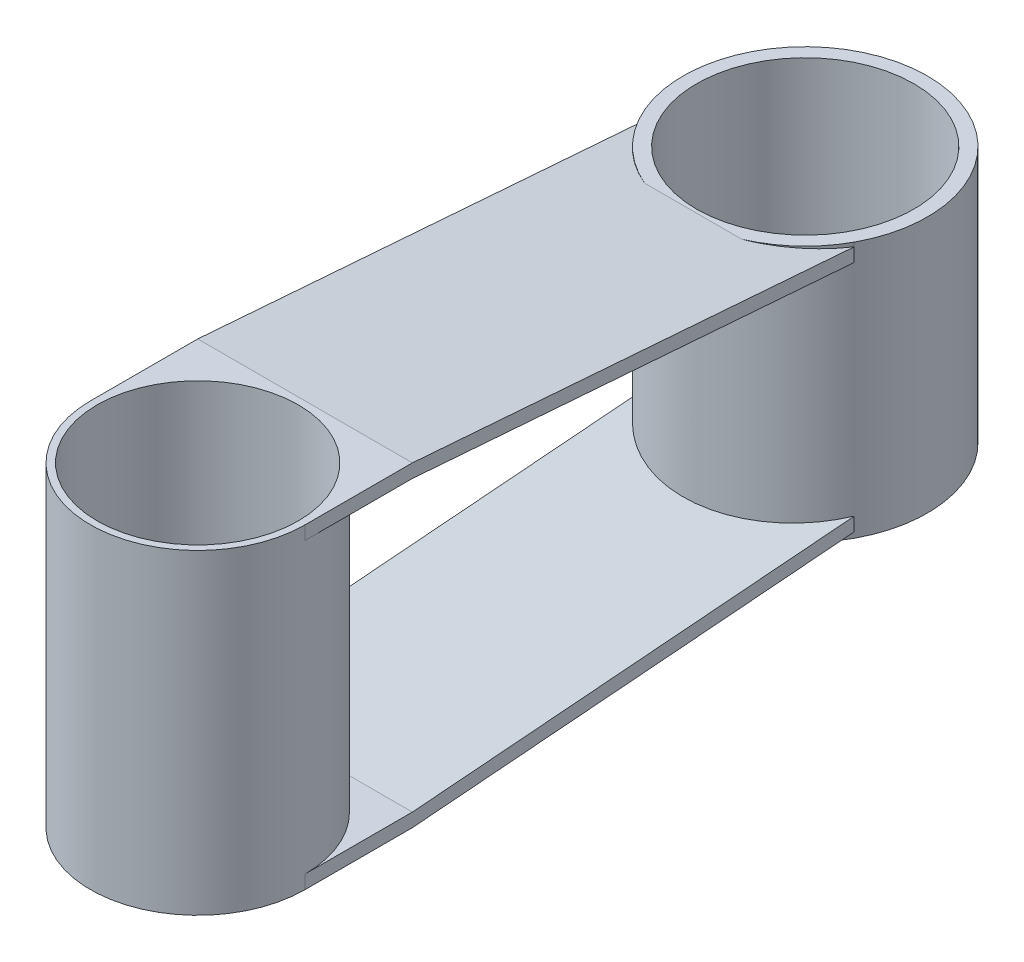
from build123d import *

# Parameters (mm, degrees)
SKETCH1_R               = 79.5
SKETCH1_R_2             = 74.5
BOSS_EXTRUDE1_DEPTH     = 117.02
BOSS_EXTRUDE2_DEPTH     = 79.5
BOSS_EXTRUDE2_2_DEPTH   = 79.5
BOSS_EXTRUDE3_REACH     = 398.591
SKETCH3_W               = 159
SKETCH3_H               = 10.031965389
SKETCH3_H_2             = 10.029297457
SKETCH4_R               = 90.5
SKETCH4_R_2             = 80.5
BOSS_EXTRUDE4_DEPTH     = 95
CUT_EXTRUDE3_DEPTH      = 561.378604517
CUT_EXTRUDE3_DEPTH_BACK = 561.378604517
SKETCH6_R               = 80.5


with BuildPart() as part:
    # Sketch1 → Boss-Extrude1 (new, symmetric)
    with BuildSketch(Plane(origin=(0, 0, 0), x_dir=(1, 0, 0), z_dir=(0, 1, 0))):
        with Locations(Location((0, 0, 0), (0, 0, 270))):
            Circle(SKETCH1_R)
        with Locations(Location((0, 0, 0), (0, 0, 270))):
            Circle(SKETCH1_R_2, mode=Mode.SUBTRACT)
    extrude(amount=BOSS_EXTRUDE1_DEPTH, both=True)

    # Sketch3 → Boss-Extrude3 (add, up to next)
    with BuildSketch(Plane.XY.offset(-79.5), mode=Mode.PRIVATE) as boss_extrude3_sk1:
        with Locations((0, -112.004017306)):
            Rectangle(SKETCH3_W, SKETCH3_H)
    boss_extrude3_tool1 = extrude(boss_extrude3_sk1.sketch, amount=BOSS_EXTRUDE3_REACH, mode=Mode.PRIVATE) - part.part
    # Sketch3 → Boss-Extrude3 (add, up to next)
    with BuildSketch(Plane.XY.offset(-79.5), mode=Mode.PRIVATE) as boss_extrude3_sk2:
        with Locations((0, 112.005351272)):
            Rectangle(SKETCH3_W, SKETCH3_H_2)
    boss_extrude3_tool2 = extrude(boss_extrude3_sk2.sketch, amount=BOSS_EXTRUDE3_REACH, mode=Mode.PRIVATE) - part.part


with BuildPart() as body_2:
    # Sketch2 → Boss-Extrude2 (new, symmetric)
    with BuildSketch(Plane(origin=(0, 0, 0), x_dir=(0, 0, -1), z_dir=(1, 0, 0))):
        Polygon((79.5, 117.02), (450, 88.638454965), (450, 78.609157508), (79.5, 106.990702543), align=None)
    extrude(amount=BOSS_EXTRUDE2_DEPTH, both=True)


with BuildPart() as body_3:
    # Sketch2 → Boss-Extrude2 2 (new, symmetric)
    with BuildSketch(Plane(origin=(0, 0, 0), x_dir=(0, 0, -1), z_dir=(1, 0, 0))):
        Polygon((79.5, -117.02), (450, -87.372369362), (450, -77.340403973), (79.5, -106.988034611), align=None)
    extrude(amount=BOSS_EXTRUDE2_2_DEPTH, both=True)


with BuildPart() as part_1:
    add(part.part)

    add(body_2.part)  # Boss-Extrude3 merges body 2

    add(body_3.part)  # Boss-Extrude3 merges body 3
    add(boss_extrude3_tool1.solids().sort_by_distance((0, -112.004017, -79.5))[0])
    add(boss_extrude3_tool1.solids().sort_by_distance((0, -112.004017, -79.5))[1])
    add(boss_extrude3_tool2.solids().sort_by_distance((0, 112.005351, -79.5))[0])
    add(boss_extrude3_tool2.solids().sort_by_distance((0, 112.005351, -79.5))[1])

    # Sketch4 → Boss-Extrude4 (add, symmetric)
    with BuildSketch(Plane(origin=(0, 0, 0), x_dir=(1, 0, 0), z_dir=(0, 1, 0))):
        with Locations(Location((0, 450, 0), (0, 0, 331.456313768))):
            Circle(SKETCH4_R)
        with Locations(Location((0, 450, 0), (0, 0, 270))):
            Circle(SKETCH4_R_2, mode=Mode.SUBTRACT)
    extrude(amount=BOSS_EXTRUDE4_DEPTH, both=True)

    # Sketch6 → Cut-Extrude3 (cut, two sides: drawn at the far end of the back side and taken through both)
    with BuildSketch(Plane(origin=(0, 0, 0), x_dir=(1, 0, 0), z_dir=(0, 1, 0)).offset(-CUT_EXTRUDE3_DEPTH_BACK)):
        with Locations(Location((0, 450, 0), (0, 0, 270))):
            Circle(SKETCH6_R)
    extrude(amount=CUT_EXTRUDE3_DEPTH + CUT_EXTRUDE3_DEPTH_BACK, mode=Mode.SUBTRACT)


solid = part_1.part
